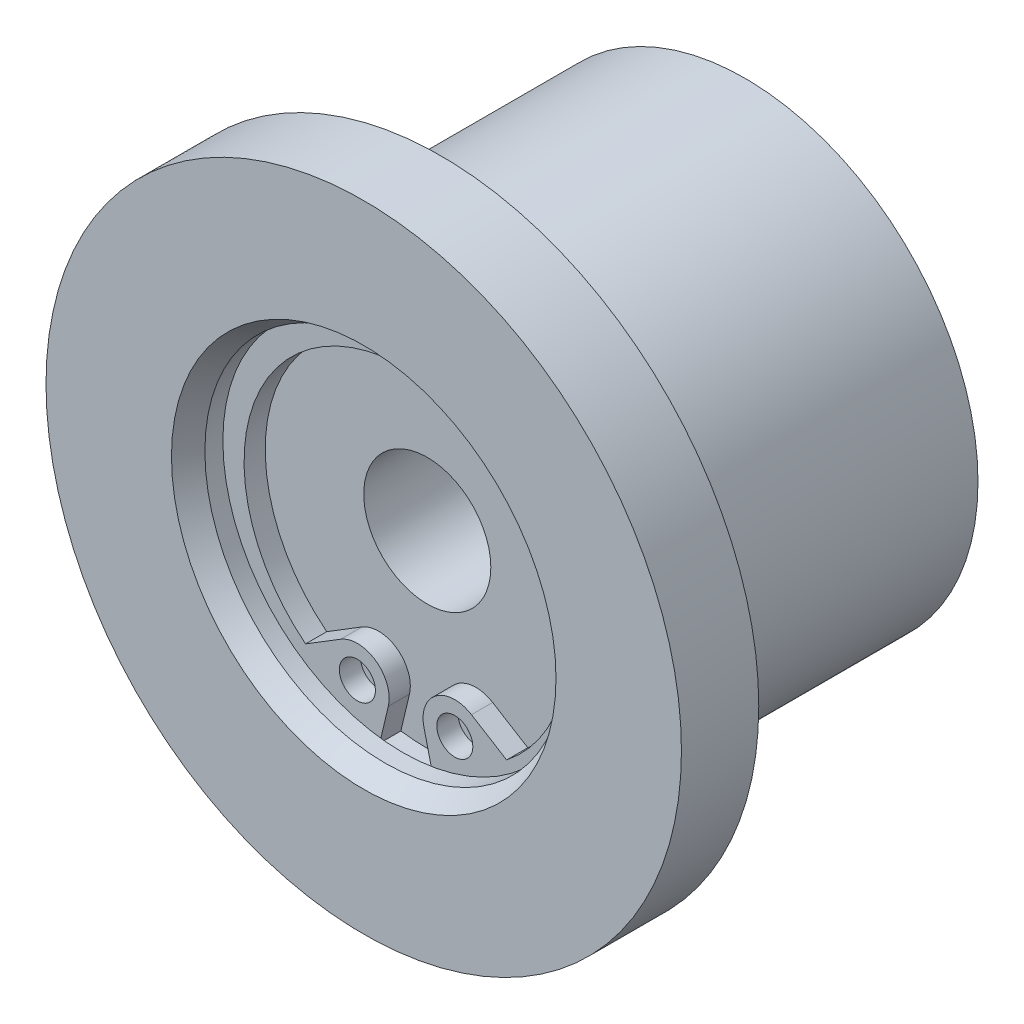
ISO-10303-21;
HEADER;
FILE_DESCRIPTION(('STEP AP214'),'2;1');
FILE_NAME('part.step','',(''),(''),'','','');
FILE_SCHEMA(('AUTOMOTIVE_DESIGN { 1 0 10303 214 1 1 1 1 }'));
ENDSEC;
DATA;
#1=APPLICATION_CONTEXT('core data for automotive mechanical design processes');
#2=APPLICATION_PROTOCOL_DEFINITION('international standard','automotive_design',2000,#1);
#3=PRODUCT_CONTEXT('',#1,'mechanical');
#4=PRODUCT('Part','Part','',(#3));
#5=PRODUCT_RELATED_PRODUCT_CATEGORY('part','',(#4));
#6=PRODUCT_DEFINITION_FORMATION('','',#4);
#7=PRODUCT_DEFINITION_CONTEXT('part definition',#1,'design');
#8=PRODUCT_DEFINITION('design','',#6,#7);
#9=PRODUCT_DEFINITION_SHAPE('','',#8);
#10=(LENGTH_UNIT() NAMED_UNIT(*) SI_UNIT(.MILLI.,.METRE.));
#11=(NAMED_UNIT(*) PLANE_ANGLE_UNIT() SI_UNIT($,.RADIAN.));
#12=(NAMED_UNIT(*) SI_UNIT($,.STERADIAN.) SOLID_ANGLE_UNIT());
#13=UNCERTAINTY_MEASURE_WITH_UNIT(LENGTH_MEASURE(1.E-05),#10,'distance_accuracy_value','');
#14=(GEOMETRIC_REPRESENTATION_CONTEXT(3) GLOBAL_UNCERTAINTY_ASSIGNED_CONTEXT((#13)) GLOBAL_UNIT_ASSIGNED_CONTEXT((#10,
#11,#12)) REPRESENTATION_CONTEXT('',''));
#15=CARTESIAN_POINT('',(0.,0.,0.));
#16=DIRECTION('',(0.,0.,1.));
#17=DIRECTION('',(1.,0.,0.));
#18=AXIS2_PLACEMENT_3D('',#15,#16,#17);
#19=CARTESIAN_POINT('',(0.,-0.5,7.));
#20=DIRECTION('',(0.,0.,1.));
#21=DIRECTION('',(-1.,0.,0.));
#22=AXIS2_PLACEMENT_3D('',#19,#20,#21);
#23=CYLINDRICAL_SURFACE('',#22,7.65);
#24=CARTESIAN_POINT('',(0.,-0.5,6.));
#25=DIRECTION('',(0.,0.,-1.));
#26=DIRECTION('',(0.,-1.,0.));
#27=AXIS2_PLACEMENT_3D('',#24,#25,#26);
#28=CIRCLE('',#27,7.65);
#29=CARTESIAN_POINT('',(-4.74513893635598,-6.50051301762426,6.));
#30=VERTEX_POINT('',#29);
#31=CARTESIAN_POINT('',(4.74513893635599,-6.50051301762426,6.));
#32=VERTEX_POINT('',#31);
#33=EDGE_CURVE('E110',#30,#32,#28,.T.);
#34=ORIENTED_EDGE('',*,*,#33,.T.);
#35=DIRECTION('',(0.,0.,-1.));
#36=VECTOR('',#35,1.);
#37=CARTESIAN_POINT('',(4.74513893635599,-6.50051301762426,7.));
#38=LINE('',#37,#36);
#39=CARTESIAN_POINT('',(4.74513893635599,-6.50051301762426,7.));
#40=VERTEX_POINT('',#39);
#41=EDGE_CURVE('E136',#40,#32,#38,.T.);
#42=ORIENTED_EDGE('',*,*,#41,.F.);
#43=CARTESIAN_POINT('',(0.,-0.5,7.));
#44=DIRECTION('',(0.,0.,-1.));
#45=DIRECTION('',(0.,-1.,0.));
#46=AXIS2_PLACEMENT_3D('',#43,#44,#45);
#47=CIRCLE('',#46,7.65);
#48=CARTESIAN_POINT('',(-4.74513893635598,-6.50051301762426,7.));
#49=VERTEX_POINT('',#48);
#50=EDGE_CURVE('E137',#49,#40,#47,.T.);
#51=ORIENTED_EDGE('',*,*,#50,.F.);
#52=DIRECTION('',(0.,0.,-1.));
#53=VECTOR('',#52,1.);
#54=CARTESIAN_POINT('',(-4.74513893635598,-6.50051301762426,7.));
#55=LINE('',#54,#53);
#56=EDGE_CURVE('E165',#49,#30,#55,.T.);
#57=ORIENTED_EDGE('',*,*,#56,.T.);
#58=EDGE_LOOP('',(#34,#42,#51,#57));
#59=FACE_BOUND('',#58,.T.);
#60=ADVANCED_FACE('F14',(#59),#23,.F.);
#61=CARTESIAN_POINT('',(3.08650226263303,-5.47917588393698,7.));
#62=DIRECTION('',(-0.524334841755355,-0.851512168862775,0.));
#63=DIRECTION('',(-0.851512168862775,0.524334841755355,0.));
#64=AXIS2_PLACEMENT_3D('',#61,#62,#63);
#65=PLANE('',#64);
#66=DIRECTION('',(-0.851512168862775,0.524334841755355,0.));
#67=VECTOR('',#66,1.);
#68=CARTESIAN_POINT('',(3.08650226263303,-5.47917588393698,6.));
#69=LINE('',#68,#67);
#70=CARTESIAN_POINT('',(3.08650226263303,-5.47917588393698,6.));
#71=VERTEX_POINT('',#70);
#72=EDGE_CURVE('E150',#32,#71,#69,.T.);
#73=ORIENTED_EDGE('',*,*,#72,.T.);
#74=DIRECTION('',(0.,0.,-1.));
#75=VECTOR('',#74,1.);
#76=CARTESIAN_POINT('',(3.08650226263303,-5.47917588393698,7.));
#77=LINE('',#76,#75);
#78=CARTESIAN_POINT('',(3.08650226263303,-5.47917588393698,7.));
#79=VERTEX_POINT('',#78);
#80=EDGE_CURVE('E145',#79,#71,#77,.T.);
#81=ORIENTED_EDGE('',*,*,#80,.F.);
#82=DIRECTION('',(-0.851512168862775,0.524334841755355,0.));
#83=VECTOR('',#82,1.);
#84=CARTESIAN_POINT('',(3.08650226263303,-5.47917588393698,7.));
#85=LINE('',#84,#83);
#86=EDGE_CURVE('E155',#40,#79,#85,.T.);
#87=ORIENTED_EDGE('',*,*,#86,.F.);
#88=ORIENTED_EDGE('',*,*,#41,.T.);
#89=EDGE_LOOP('',(#73,#81,#87,#88));
#90=FACE_BOUND('',#89,.T.);
#91=ADVANCED_FACE('F292',(#90),#65,.F.);
#92=CARTESIAN_POINT('',(2.3,-6.75644413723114,7.));
#93=DIRECTION('',(0.,0.,1.));
#94=DIRECTION('',(-1.,0.,0.));
#95=AXIS2_PLACEMENT_3D('',#92,#93,#94);
#96=CYLINDRICAL_SURFACE('',#95,1.5);
#97=CARTESIAN_POINT('',(2.3,-6.75644413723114,6.));
#98=DIRECTION('',(0.,0.,1.));
#99=DIRECTION('',(1.,0.,0.));
#100=AXIS2_PLACEMENT_3D('',#97,#98,#99);
#101=CIRCLE('',#100,1.5);
#102=CARTESIAN_POINT('',(0.840693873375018,-7.10346809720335,6.));
#103=VERTEX_POINT('',#102);
#104=EDGE_CURVE('E160',#71,#103,#101,.T.);
#105=ORIENTED_EDGE('',*,*,#104,.T.);
#106=DIRECTION('',(0.,0.,-1.));
#107=VECTOR('',#106,1.);
#108=CARTESIAN_POINT('',(0.840693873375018,-7.10346809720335,7.));
#109=LINE('',#108,#107);
#110=CARTESIAN_POINT('',(0.840693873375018,-7.10346809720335,7.));
#111=VERTEX_POINT('',#110);
#112=EDGE_CURVE('E146',#111,#103,#109,.T.);
#113=ORIENTED_EDGE('',*,*,#112,.F.);
#114=CARTESIAN_POINT('',(2.3,-6.75644413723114,7.));
#115=DIRECTION('',(0.,0.,1.));
#116=DIRECTION('',(1.,0.,0.));
#117=AXIS2_PLACEMENT_3D('',#114,#115,#116);
#118=CIRCLE('',#117,1.5);
#119=EDGE_CURVE('E151',#79,#111,#118,.T.);
#120=ORIENTED_EDGE('',*,*,#119,.F.);
#121=ORIENTED_EDGE('',*,*,#80,.T.);
#122=EDGE_LOOP('',(#105,#113,#120,#121));
#123=FACE_BOUND('',#122,.T.);
#124=ADVANCED_FACE('F238',(#123),#96,.T.);
#125=CARTESIAN_POINT('',(-0.84069387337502,-7.10346809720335,7.));
#126=DIRECTION('',(-0.97287075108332,0.231349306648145,0.));
#127=DIRECTION('',(0.,0.,1.));
#128=AXIS2_PLACEMENT_3D('',#125,#126,#127);
#129=PLANE('',#128);
#130=DIRECTION('',(0.,0.,1.));
#131=VECTOR('',#130,1.);
#132=CARTESIAN_POINT('',(-1.24703201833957,-8.81220240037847,5.6342229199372));
#133=LINE('',#132,#131);
#134=CARTESIAN_POINT('',(-1.24703201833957,-8.81220240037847,6.));
#135=VERTEX_POINT('',#134);
#136=CARTESIAN_POINT('',(-1.24703201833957,-8.81220240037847,7.));
#137=VERTEX_POINT('',#136);
#138=EDGE_CURVE('E115',#135,#137,#133,.T.);
#139=ORIENTED_EDGE('',*,*,#138,.F.);
#140=DIRECTION('',(0.231349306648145,0.97287075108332,0.));
#141=VECTOR('',#140,1.);
#142=CARTESIAN_POINT('',(-0.84069387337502,-7.10346809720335,6.));
#143=LINE('',#142,#141);
#144=CARTESIAN_POINT('',(-0.84069387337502,-7.10346809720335,6.));
#145=VERTEX_POINT('',#144);
#146=EDGE_CURVE('E103',#135,#145,#143,.T.);
#147=ORIENTED_EDGE('',*,*,#146,.T.);
#148=DIRECTION('',(0.,0.,-1.));
#149=VECTOR('',#148,1.);
#150=CARTESIAN_POINT('',(-0.84069387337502,-7.10346809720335,7.));
#151=LINE('',#150,#149);
#152=CARTESIAN_POINT('',(-0.84069387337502,-7.10346809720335,7.));
#153=VERTEX_POINT('',#152);
#154=EDGE_CURVE('E99',#153,#145,#151,.T.);
#155=ORIENTED_EDGE('',*,*,#154,.F.);
#156=DIRECTION('',(0.231349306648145,0.97287075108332,0.));
#157=VECTOR('',#156,1.);
#158=CARTESIAN_POINT('',(-0.84069387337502,-7.10346809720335,7.));
#159=LINE('',#158,#157);
#160=EDGE_CURVE('E141',#137,#153,#159,.T.);
#161=ORIENTED_EDGE('',*,*,#160,.F.);
#162=EDGE_LOOP('',(#139,#147,#155,#161));
#163=FACE_BOUND('',#162,.T.);
#164=ADVANCED_FACE('F259',(#163),#129,.F.);
#165=CARTESIAN_POINT('',(0.,-0.5,7.));
#166=DIRECTION('',(0.,0.,-1.));
#167=DIRECTION('',(0.,-1.,0.));
#168=AXIS2_PLACEMENT_3D('',#165,#166,#167);
#169=PLANE('',#168);
#170=CARTESIAN_POINT('',(2.3,-6.75644413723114,7.));
#171=DIRECTION('',(0.,0.,1.));
#172=DIRECTION('',(1.,0.,0.));
#173=AXIS2_PLACEMENT_3D('',#170,#171,#172);
#174=CIRCLE('',#173,0.85);
#175=CARTESIAN_POINT('',(3.15,-6.75644413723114,7.));
#176=VERTEX_POINT('',#175);
#177=EDGE_CURVE('E130',#176,#176,#174,.T.);
#178=ORIENTED_EDGE('',*,*,#177,.F.);
#179=EDGE_LOOP('',(#178));
#180=FACE_BOUND('',#179,.T.);
#181=CARTESIAN_POINT('',(-2.3,-6.75644413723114,7.));
#182=DIRECTION('',(0.,0.,-1.));
#183=DIRECTION('',(1.,0.,0.));
#184=AXIS2_PLACEMENT_3D('',#181,#182,#183);
#185=CIRCLE('',#184,0.85);
#186=CARTESIAN_POINT('',(-1.45,-6.75644413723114,7.));
#187=VERTEX_POINT('',#186);
#188=EDGE_CURVE('E142',#187,#187,#185,.T.);
#189=ORIENTED_EDGE('',*,*,#188,.T.);
#190=EDGE_LOOP('',(#189));
#191=FACE_BOUND('',#190,.T.);
#192=CARTESIAN_POINT('',(0.,0.,7.));
#193=DIRECTION('',(0.,0.,-1.));
#194=DIRECTION('',(-1.,0.,0.));
#195=AXIS2_PLACEMENT_3D('',#192,#193,#194);
#196=CIRCLE('',#195,8.9);
#197=CARTESIAN_POINT('',(1.24703201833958,-8.81220240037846,7.));
#198=VERTEX_POINT('',#197);
#199=EDGE_CURVE('E9',#137,#198,#196,.T.);
#200=ORIENTED_EDGE('',*,*,#199,.F.);
#201=ORIENTED_EDGE('',*,*,#160,.T.);
#202=CARTESIAN_POINT('',(-2.3,-6.75644413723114,7.));
#203=DIRECTION('',(0.,0.,1.));
#204=DIRECTION('',(-1.,0.,0.));
#205=AXIS2_PLACEMENT_3D('',#202,#203,#204);
#206=CIRCLE('',#205,1.5);
#207=CARTESIAN_POINT('',(-3.08650226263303,-5.47917588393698,7.));
#208=VERTEX_POINT('',#207);
#209=EDGE_CURVE('E138',#153,#208,#206,.T.);
#210=ORIENTED_EDGE('',*,*,#209,.T.);
#211=DIRECTION('',(-0.851512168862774,-0.524334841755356,0.));
#212=VECTOR('',#211,1.);
#213=CARTESIAN_POINT('',(-3.08650226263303,-5.47917588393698,7.));
#214=LINE('',#213,#212);
#215=EDGE_CURVE('E118',#208,#49,#214,.T.);
#216=ORIENTED_EDGE('',*,*,#215,.T.);
#217=ORIENTED_EDGE('',*,*,#50,.T.);
#218=ORIENTED_EDGE('',*,*,#86,.T.);
#219=ORIENTED_EDGE('',*,*,#119,.T.);
#220=DIRECTION('',(0.231349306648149,-0.972870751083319,0.));
#221=VECTOR('',#220,1.);
#222=CARTESIAN_POINT('',(0.840693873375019,-7.10346809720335,7.));
#223=LINE('',#222,#221);
#224=EDGE_CURVE('E156',#111,#198,#223,.T.);
#225=ORIENTED_EDGE('',*,*,#224,.T.);
#226=EDGE_LOOP('',(#200,#201,#210,#216,#217,#218,#219,#225));
#227=FACE_BOUND('',#226,.T.);
#228=ADVANCED_FACE('F255',(#180,#191,#227),#169,.F.);
#229=CARTESIAN_POINT('',(2.3,-6.75644413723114,7.));
#230=DIRECTION('',(0.,0.,1.));
#231=DIRECTION('',(-1.,0.,0.));
#232=AXIS2_PLACEMENT_3D('',#229,#230,#231);
#233=CYLINDRICAL_SURFACE('',#232,0.85);
#234=CARTESIAN_POINT('',(2.3,-6.75644413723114,6.));
#235=DIRECTION('',(0.,0.,1.));
#236=DIRECTION('',(1.,0.,0.));
#237=AXIS2_PLACEMENT_3D('',#234,#235,#236);
#238=CIRCLE('',#237,0.85);
#239=CARTESIAN_POINT('',(3.15,-6.75644413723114,6.));
#240=VERTEX_POINT('',#239);
#241=EDGE_CURVE('E120',#240,#240,#238,.T.);
#242=ORIENTED_EDGE('',*,*,#241,.F.);
#243=EDGE_LOOP('',(#242));
#244=FACE_BOUND('',#243,.T.);
#245=ORIENTED_EDGE('',*,*,#177,.T.);
#246=EDGE_LOOP('',(#245));
#247=FACE_BOUND('',#246,.T.);
#248=ADVANCED_FACE('F304',(#244,#247),#233,.F.);
#249=CARTESIAN_POINT('',(-2.3,-6.75644413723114,7.));
#250=DIRECTION('',(0.,0.,1.));
#251=DIRECTION('',(-1.,0.,0.));
#252=AXIS2_PLACEMENT_3D('',#249,#250,#251);
#253=CYLINDRICAL_SURFACE('',#252,0.85);
#254=CARTESIAN_POINT('',(-2.3,-6.75644413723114,6.));
#255=DIRECTION('',(0.,0.,-1.));
#256=DIRECTION('',(1.,0.,0.));
#257=AXIS2_PLACEMENT_3D('',#254,#255,#256);
#258=CIRCLE('',#257,0.85);
#259=CARTESIAN_POINT('',(-1.45,-6.75644413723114,6.));
#260=VERTEX_POINT('',#259);
#261=EDGE_CURVE('E133',#260,#260,#258,.T.);
#262=ORIENTED_EDGE('',*,*,#261,.T.);
#263=EDGE_LOOP('',(#262));
#264=FACE_BOUND('',#263,.T.);
#265=ORIENTED_EDGE('',*,*,#188,.F.);
#266=EDGE_LOOP('',(#265));
#267=FACE_BOUND('',#266,.T.);
#268=ADVANCED_FACE('F478',(#264,#267),#253,.F.);
#269=CARTESIAN_POINT('',(-3.08650226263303,-5.47917588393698,7.));
#270=DIRECTION('',(0.524334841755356,-0.851512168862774,0.));
#271=DIRECTION('',(0.,0.,-1.));
#272=AXIS2_PLACEMENT_3D('',#269,#270,#271);
#273=PLANE('',#272);
#274=DIRECTION('',(-0.851512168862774,-0.524334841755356,0.));
#275=VECTOR('',#274,1.);
#276=CARTESIAN_POINT('',(-3.08650226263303,-5.47917588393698,6.));
#277=LINE('',#276,#275);
#278=CARTESIAN_POINT('',(-3.08650226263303,-5.47917588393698,6.));
#279=VERTEX_POINT('',#278);
#280=EDGE_CURVE('E106',#279,#30,#277,.T.);
#281=ORIENTED_EDGE('',*,*,#280,.T.);
#282=ORIENTED_EDGE('',*,*,#56,.F.);
#283=ORIENTED_EDGE('',*,*,#215,.F.);
#284=DIRECTION('',(0.,0.,-1.));
#285=VECTOR('',#284,1.);
#286=CARTESIAN_POINT('',(-3.08650226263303,-5.47917588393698,7.));
#287=LINE('',#286,#285);
#288=EDGE_CURVE('E96',#208,#279,#287,.T.);
#289=ORIENTED_EDGE('',*,*,#288,.T.);
#290=EDGE_LOOP('',(#281,#282,#283,#289));
#291=FACE_BOUND('',#290,.T.);
#292=ADVANCED_FACE('F117',(#291),#273,.F.);
#293=CARTESIAN_POINT('',(-2.3,-6.75644413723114,7.));
#294=DIRECTION('',(0.,0.,1.));
#295=DIRECTION('',(-1.,0.,0.));
#296=AXIS2_PLACEMENT_3D('',#293,#294,#295);
#297=CYLINDRICAL_SURFACE('',#296,1.5);
#298=CARTESIAN_POINT('',(-2.3,-6.75644413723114,6.));
#299=DIRECTION('',(0.,0.,1.));
#300=DIRECTION('',(-1.,0.,0.));
#301=AXIS2_PLACEMENT_3D('',#298,#299,#300);
#302=CIRCLE('',#301,1.5);
#303=EDGE_CURVE('E91',#145,#279,#302,.T.);
#304=ORIENTED_EDGE('',*,*,#303,.T.);
#305=ORIENTED_EDGE('',*,*,#288,.F.);
#306=ORIENTED_EDGE('',*,*,#209,.F.);
#307=ORIENTED_EDGE('',*,*,#154,.T.);
#308=EDGE_LOOP('',(#304,#305,#306,#307));
#309=FACE_BOUND('',#308,.T.);
#310=ADVANCED_FACE('F93',(#309),#297,.T.);
#311=CARTESIAN_POINT('',(0.840693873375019,-7.10346809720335,7.));
#312=DIRECTION('',(0.972870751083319,0.231349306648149,0.));
#313=DIRECTION('',(0.,0.,-1.));
#314=AXIS2_PLACEMENT_3D('',#311,#312,#313);
#315=PLANE('',#314);
#316=DIRECTION('',(0.,0.,1.));
#317=VECTOR('',#316,1.);
#318=CARTESIAN_POINT('',(1.24703201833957,-8.81220240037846,5.6342229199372));
#319=LINE('',#318,#317);
#320=CARTESIAN_POINT('',(1.24703201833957,-8.81220240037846,6.));
#321=VERTEX_POINT('',#320);
#322=EDGE_CURVE('E18',#198,#321,#319,.F.);
#323=ORIENTED_EDGE('',*,*,#322,.F.);
#324=ORIENTED_EDGE('',*,*,#224,.F.);
#325=ORIENTED_EDGE('',*,*,#112,.T.);
#326=DIRECTION('',(0.231349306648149,-0.972870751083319,0.));
#327=VECTOR('',#326,1.);
#328=CARTESIAN_POINT('',(0.840693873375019,-7.10346809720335,6.));
#329=LINE('',#328,#327);
#330=EDGE_CURVE('E32',#103,#321,#329,.T.);
#331=ORIENTED_EDGE('',*,*,#330,.T.);
#332=EDGE_LOOP('',(#323,#324,#325,#331));
#333=FACE_BOUND('',#332,.T.);
#334=ADVANCED_FACE('F241',(#333),#315,.F.);
#335=CARTESIAN_POINT('',(0.,3.,6.));
#336=DIRECTION('',(0.,0.,-1.));
#337=DIRECTION('',(-1.,0.,0.));
#338=AXIS2_PLACEMENT_3D('',#335,#336,#337);
#339=PLANE('',#338);
#340=ORIENTED_EDGE('',*,*,#241,.T.);
#341=EDGE_LOOP('',(#340));
#342=FACE_BOUND('',#341,.T.);
#343=ADVANCED_FACE('F278',(#342),#339,.F.);
#344=ORIENTED_EDGE('',*,*,#261,.F.);
#345=EDGE_LOOP('',(#344));
#346=FACE_BOUND('',#345,.T.);
#347=ADVANCED_FACE('F280',(#346),#339,.F.);
#348=CARTESIAN_POINT('',(0.,0.,5.));
#349=DIRECTION('',(0.,0.,1.));
#350=DIRECTION('',(1.,0.,0.));
#351=AXIS2_PLACEMENT_3D('',#348,#349,#350);
#352=CONICAL_SURFACE('',#351,11.,1.48352986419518);
#353=CARTESIAN_POINT('',(0.,0.,5.34995465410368));
#354=DIRECTION('',(0.,0.,1.));
#355=DIRECTION('',(1.,0.,0.));
#356=AXIS2_PLACEMENT_3D('',#353,#354,#355);
#357=CIRCLE('',#356,15.);
#358=CARTESIAN_POINT('',(15.,0.,5.34995465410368));
#359=VERTEX_POINT('',#358);
#360=EDGE_CURVE('E204',#359,#359,#357,.T.);
#361=ORIENTED_EDGE('',*,*,#360,.F.);
#362=EDGE_LOOP('',(#361));
#363=FACE_BOUND('',#362,.T.);
#364=CARTESIAN_POINT('',(0.,0.,5.));
#365=DIRECTION('',(0.,0.,1.));
#366=DIRECTION('',(1.,0.,0.));
#367=AXIS2_PLACEMENT_3D('',#364,#365,#366);
#368=CIRCLE('',#367,11.);
#369=CARTESIAN_POINT('',(11.,0.,5.));
#370=VERTEX_POINT('',#369);
#371=EDGE_CURVE('E207',#370,#370,#368,.T.);
#372=ORIENTED_EDGE('',*,*,#371,.T.);
#373=EDGE_LOOP('',(#372));
#374=FACE_BOUND('',#373,.T.);
#375=ADVANCED_FACE('F286',(#363,#374),#352,.T.);
#376=CARTESIAN_POINT('',(0.,0.,5.6342229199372));
#377=DIRECTION('',(0.,0.,1.));
#378=DIRECTION('',(1.,0.,0.));
#379=AXIS2_PLACEMENT_3D('',#376,#377,#378);
#380=CYLINDRICAL_SURFACE('',#379,15.);
#381=CARTESIAN_POINT('',(0.,0.,9.));
#382=DIRECTION('',(0.,0.,1.));
#383=DIRECTION('',(1.,0.,0.));
#384=AXIS2_PLACEMENT_3D('',#381,#382,#383);
#385=CIRCLE('',#384,15.);
#386=CARTESIAN_POINT('',(15.,0.,9.));
#387=VERTEX_POINT('',#386);
#388=EDGE_CURVE('E201',#387,#387,#385,.T.);
#389=ORIENTED_EDGE('',*,*,#388,.F.);
#390=EDGE_LOOP('',(#389));
#391=FACE_BOUND('',#390,.T.);
#392=ORIENTED_EDGE('',*,*,#360,.T.);
#393=EDGE_LOOP('',(#392));
#394=FACE_BOUND('',#393,.T.);
#395=ADVANCED_FACE('F343',(#391,#394),#380,.T.);
#396=CARTESIAN_POINT('',(0.,0.,5.6342229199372));
#397=DIRECTION('',(0.,0.,1.));
#398=DIRECTION('',(1.,0.,0.));
#399=AXIS2_PLACEMENT_3D('',#396,#397,#398);
#400=CYLINDRICAL_SURFACE('',#399,11.);
#401=ORIENTED_EDGE('',*,*,#371,.F.);
#402=EDGE_LOOP('',(#401));
#403=FACE_BOUND('',#402,.T.);
#404=CARTESIAN_POINT('',(0.,0.,-9.));
#405=DIRECTION('',(0.,0.,1.));
#406=DIRECTION('',(1.,0.,0.));
#407=AXIS2_PLACEMENT_3D('',#404,#405,#406);
#408=CIRCLE('',#407,11.);
#409=CARTESIAN_POINT('',(11.,0.,-9.));
#410=VERTEX_POINT('',#409);
#411=EDGE_CURVE('E172',#410,#410,#408,.T.);
#412=ORIENTED_EDGE('',*,*,#411,.T.);
#413=EDGE_LOOP('',(#412));
#414=FACE_BOUND('',#413,.T.);
#415=ADVANCED_FACE('F16',(#403,#414),#400,.T.);
#416=CARTESIAN_POINT('',(0.,15.,9.));
#417=DIRECTION('',(0.,0.,-1.));
#418=DIRECTION('',(-1.,0.,0.));
#419=AXIS2_PLACEMENT_3D('',#416,#417,#418);
#420=PLANE('',#419);
#421=CARTESIAN_POINT('',(0.,0.,9.));
#422=DIRECTION('',(0.,0.,1.));
#423=DIRECTION('',(1.,0.,0.));
#424=AXIS2_PLACEMENT_3D('',#421,#422,#423);
#425=CIRCLE('',#424,9.07735026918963);
#426=CARTESIAN_POINT('',(9.07735026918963,0.,9.));
#427=VERTEX_POINT('',#426);
#428=EDGE_CURVE('E198',#427,#427,#425,.T.);
#429=ORIENTED_EDGE('',*,*,#428,.F.);
#430=EDGE_LOOP('',(#429));
#431=FACE_BOUND('',#430,.T.);
#432=ORIENTED_EDGE('',*,*,#388,.T.);
#433=EDGE_LOOP('',(#432));
#434=FACE_BOUND('',#433,.T.);
#435=ADVANCED_FACE('F312',(#431,#434),#420,.F.);
#436=CARTESIAN_POINT('',(0.,6.5,-9.));
#437=DIRECTION('',(0.,0.,1.));
#438=DIRECTION('',(1.,0.,0.));
#439=AXIS2_PLACEMENT_3D('',#436,#437,#438);
#440=PLANE('',#439);
#441=ORIENTED_EDGE('',*,*,#411,.F.);
#442=EDGE_LOOP('',(#441));
#443=FACE_BOUND('',#442,.T.);
#444=CARTESIAN_POINT('',(0.,0.,-9.));
#445=DIRECTION('',(0.,0.,1.));
#446=DIRECTION('',(1.,0.,0.));
#447=AXIS2_PLACEMENT_3D('',#444,#445,#446);
#448=CIRCLE('',#447,6.5);
#449=CARTESIAN_POINT('',(6.5,0.,-9.));
#450=VERTEX_POINT('',#449);
#451=EDGE_CURVE('E175',#450,#450,#448,.T.);
#452=ORIENTED_EDGE('',*,*,#451,.T.);
#453=EDGE_LOOP('',(#452));
#454=FACE_BOUND('',#453,.T.);
#455=ADVANCED_FACE('F308',(#443,#454),#440,.F.);
#456=CARTESIAN_POINT('',(0.,0.,9.));
#457=DIRECTION('',(0.,0.,1.));
#458=DIRECTION('',(1.,0.,0.));
#459=AXIS2_PLACEMENT_3D('',#456,#457,#458);
#460=CONICAL_SURFACE('',#459,9.07735026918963,0.523598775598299);
#461=CARTESIAN_POINT('',(0.,0.,8.));
#462=DIRECTION('',(0.,0.,1.));
#463=DIRECTION('',(1.,0.,0.));
#464=AXIS2_PLACEMENT_3D('',#461,#462,#463);
#465=CIRCLE('',#464,8.5);
#466=CARTESIAN_POINT('',(8.5,0.,8.));
#467=VERTEX_POINT('',#466);
#468=EDGE_CURVE('E195',#467,#467,#465,.T.);
#469=ORIENTED_EDGE('',*,*,#468,.F.);
#470=EDGE_LOOP('',(#469));
#471=FACE_BOUND('',#470,.T.);
#472=ORIENTED_EDGE('',*,*,#428,.T.);
#473=EDGE_LOOP('',(#472));
#474=FACE_BOUND('',#473,.T.);
#475=ADVANCED_FACE('F311',(#471,#474),#460,.F.);
#476=CARTESIAN_POINT('',(0.,0.,5.6342229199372));
#477=DIRECTION('',(0.,0.,1.));
#478=DIRECTION('',(1.,0.,0.));
#479=AXIS2_PLACEMENT_3D('',#476,#477,#478);
#480=CYLINDRICAL_SURFACE('',#479,6.5);
#481=ORIENTED_EDGE('',*,*,#451,.F.);
#482=EDGE_LOOP('',(#481));
#483=FACE_BOUND('',#482,.T.);
#484=CARTESIAN_POINT('',(0.,0.,-6.));
#485=DIRECTION('',(0.,0.,1.));
#486=DIRECTION('',(1.,0.,0.));
#487=AXIS2_PLACEMENT_3D('',#484,#485,#486);
#488=CIRCLE('',#487,6.5);
#489=CARTESIAN_POINT('',(6.5,0.,-6.));
#490=VERTEX_POINT('',#489);
#491=EDGE_CURVE('E178',#490,#490,#488,.T.);
#492=ORIENTED_EDGE('',*,*,#491,.T.);
#493=EDGE_LOOP('',(#492));
#494=FACE_BOUND('',#493,.T.);
#495=ADVANCED_FACE('F314',(#483,#494),#480,.F.);
#496=CARTESIAN_POINT('',(0.,0.,5.6342229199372));
#497=DIRECTION('',(0.,0.,1.));
#498=DIRECTION('',(1.,0.,0.));
#499=AXIS2_PLACEMENT_3D('',#496,#497,#498);
#500=CYLINDRICAL_SURFACE('',#499,8.5);
#501=CARTESIAN_POINT('',(0.,0.,7.15));
#502=DIRECTION('',(0.,0.,1.));
#503=DIRECTION('',(1.,0.,0.));
#504=AXIS2_PLACEMENT_3D('',#501,#502,#503);
#505=CIRCLE('',#504,8.5);
#506=CARTESIAN_POINT('',(8.5,0.,7.15));
#507=VERTEX_POINT('',#506);
#508=EDGE_CURVE('E192',#507,#507,#505,.T.);
#509=ORIENTED_EDGE('',*,*,#508,.F.);
#510=EDGE_LOOP('',(#509));
#511=FACE_BOUND('',#510,.T.);
#512=ORIENTED_EDGE('',*,*,#468,.T.);
#513=EDGE_LOOP('',(#512));
#514=FACE_BOUND('',#513,.T.);
#515=ADVANCED_FACE('F317',(#511,#514),#500,.F.);
#516=CARTESIAN_POINT('',(0.,6.5,-6.));
#517=DIRECTION('',(0.,0.,1.));
#518=DIRECTION('',(1.,0.,0.));
#519=AXIS2_PLACEMENT_3D('',#516,#517,#518);
#520=PLANE('',#519);
#521=ORIENTED_EDGE('',*,*,#491,.F.);
#522=EDGE_LOOP('',(#521));
#523=FACE_BOUND('',#522,.T.);
#524=CARTESIAN_POINT('',(0.,0.,-6.));
#525=DIRECTION('',(0.,0.,1.));
#526=DIRECTION('',(1.,0.,0.));
#527=AXIS2_PLACEMENT_3D('',#524,#525,#526);
#528=CIRCLE('',#527,3.);
#529=CARTESIAN_POINT('',(3.,0.,-6.));
#530=VERTEX_POINT('',#529);
#531=EDGE_CURVE('E181',#530,#530,#528,.T.);
#532=ORIENTED_EDGE('',*,*,#531,.T.);
#533=EDGE_LOOP('',(#532));
#534=FACE_BOUND('',#533,.T.);
#535=ADVANCED_FACE('F274',(#523,#534),#520,.F.);
#536=CARTESIAN_POINT('',(0.,8.9,7.15));
#537=DIRECTION('',(0.,0.,1.));
#538=DIRECTION('',(1.,0.,0.));
#539=AXIS2_PLACEMENT_3D('',#536,#537,#538);
#540=PLANE('',#539);
#541=CARTESIAN_POINT('',(0.,0.,7.15));
#542=DIRECTION('',(0.,0.,1.));
#543=DIRECTION('',(1.,0.,0.));
#544=AXIS2_PLACEMENT_3D('',#541,#542,#543);
#545=CIRCLE('',#544,8.9);
#546=CARTESIAN_POINT('',(8.9,0.,7.15));
#547=VERTEX_POINT('',#546);
#548=EDGE_CURVE('E189',#547,#547,#545,.T.);
#549=ORIENTED_EDGE('',*,*,#548,.F.);
#550=EDGE_LOOP('',(#549));
#551=FACE_BOUND('',#550,.T.);
#552=ORIENTED_EDGE('',*,*,#508,.T.);
#553=EDGE_LOOP('',(#552));
#554=FACE_BOUND('',#553,.T.);
#555=ADVANCED_FACE('F264',(#551,#554),#540,.F.);
#556=CARTESIAN_POINT('',(0.,0.,5.6342229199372));
#557=DIRECTION('',(0.,0.,1.));
#558=DIRECTION('',(1.,0.,0.));
#559=AXIS2_PLACEMENT_3D('',#556,#557,#558);
#560=CYLINDRICAL_SURFACE('',#559,8.9);
#561=ORIENTED_EDGE('',*,*,#548,.T.);
#562=EDGE_LOOP('',(#561));
#563=FACE_BOUND('',#562,.T.);
#564=ORIENTED_EDGE('',*,*,#199,.T.);
#565=ORIENTED_EDGE('',*,*,#322,.T.);
#566=CARTESIAN_POINT('',(0.,0.,6.));
#567=DIRECTION('',(0.,0.,1.));
#568=DIRECTION('',(1.,0.,0.));
#569=AXIS2_PLACEMENT_3D('',#566,#567,#568);
#570=CIRCLE('',#569,8.9);
#571=EDGE_CURVE('E187',#135,#321,#570,.T.);
#572=ORIENTED_EDGE('',*,*,#571,.F.);
#573=ORIENTED_EDGE('',*,*,#138,.T.);
#574=EDGE_LOOP('',(#564,#565,#572,#573));
#575=FACE_BOUND('',#574,.T.);
#576=ADVANCED_FACE('F261',(#563,#575),#560,.F.);
#577=CARTESIAN_POINT('',(0.,0.,5.6342229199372));
#578=DIRECTION('',(0.,0.,1.));
#579=DIRECTION('',(1.,0.,0.));
#580=AXIS2_PLACEMENT_3D('',#577,#578,#579);
#581=CYLINDRICAL_SURFACE('',#580,3.);
#582=ORIENTED_EDGE('',*,*,#531,.F.);
#583=EDGE_LOOP('',(#582));
#584=FACE_BOUND('',#583,.T.);
#585=CARTESIAN_POINT('',(0.,0.,6.));
#586=DIRECTION('',(0.,0.,1.));
#587=DIRECTION('',(1.,0.,0.));
#588=AXIS2_PLACEMENT_3D('',#585,#586,#587);
#589=CIRCLE('',#588,3.);
#590=CARTESIAN_POINT('',(3.,0.,6.));
#591=VERTEX_POINT('',#590);
#592=EDGE_CURVE('E184',#591,#591,#589,.T.);
#593=ORIENTED_EDGE('',*,*,#592,.T.);
#594=EDGE_LOOP('',(#593));
#595=FACE_BOUND('',#594,.T.);
#596=ADVANCED_FACE('F263',(#584,#595),#581,.F.);
#597=ORIENTED_EDGE('',*,*,#592,.F.);
#598=EDGE_LOOP('',(#597));
#599=FACE_BOUND('',#598,.T.);
#600=ORIENTED_EDGE('',*,*,#571,.T.);
#601=ORIENTED_EDGE('',*,*,#330,.F.);
#602=ORIENTED_EDGE('',*,*,#104,.F.);
#603=ORIENTED_EDGE('',*,*,#72,.F.);
#604=ORIENTED_EDGE('',*,*,#33,.F.);
#605=ORIENTED_EDGE('',*,*,#280,.F.);
#606=ORIENTED_EDGE('',*,*,#303,.F.);
#607=ORIENTED_EDGE('',*,*,#146,.F.);
#608=EDGE_LOOP('',(#600,#601,#602,#603,#604,#605,#606,#607));
#609=FACE_BOUND('',#608,.T.);
#610=ADVANCED_FACE('F108',(#599,#609),#339,.F.);
#611=CLOSED_SHELL('',(#60,#91,#124,#164,#228,#248,#268,#292,#310,#334,#343,#347,#375,#395,#415,
#435,#455,#475,#495,#515,#535,#555,#576,#596,#610));
#612=MANIFOLD_SOLID_BREP('B1',#611);
#613=ADVANCED_BREP_SHAPE_REPRESENTATION('',(#18,#612),#14);
#614=SHAPE_DEFINITION_REPRESENTATION(#9,#613);
ENDSEC;
END-ISO-10303-21;
